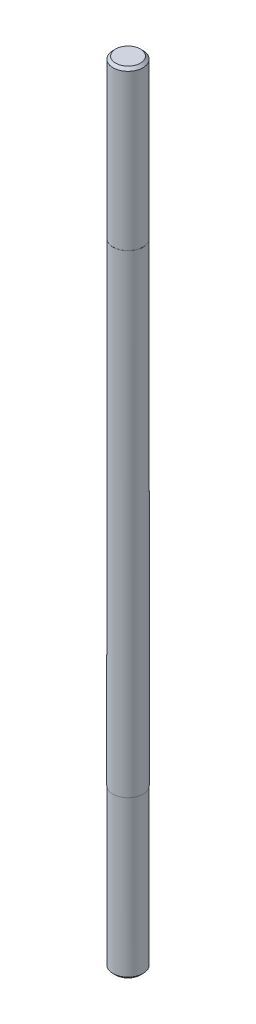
ISO-10303-21;
HEADER;
FILE_DESCRIPTION(('STEP AP214'),'2;1');
FILE_NAME('part.step','',(''),(''),'','','');
FILE_SCHEMA(('AUTOMOTIVE_DESIGN { 1 0 10303 214 1 1 1 1 }'));
ENDSEC;
DATA;
#1=APPLICATION_CONTEXT('core data for automotive mechanical design processes');
#2=APPLICATION_PROTOCOL_DEFINITION('international standard','automotive_design',2000,#1);
#3=PRODUCT_CONTEXT('',#1,'mechanical');
#4=PRODUCT('Part','Part','',(#3));
#5=PRODUCT_RELATED_PRODUCT_CATEGORY('part','',(#4));
#6=PRODUCT_DEFINITION_FORMATION('','',#4);
#7=PRODUCT_DEFINITION_CONTEXT('part definition',#1,'design');
#8=PRODUCT_DEFINITION('design','',#6,#7);
#9=PRODUCT_DEFINITION_SHAPE('','',#8);
#10=(LENGTH_UNIT() NAMED_UNIT(*) SI_UNIT(.MILLI.,.METRE.));
#11=(NAMED_UNIT(*) PLANE_ANGLE_UNIT() SI_UNIT($,.RADIAN.));
#12=(NAMED_UNIT(*) SI_UNIT($,.STERADIAN.) SOLID_ANGLE_UNIT());
#13=UNCERTAINTY_MEASURE_WITH_UNIT(LENGTH_MEASURE(1.E-05),#10,'distance_accuracy_value','');
#14=(GEOMETRIC_REPRESENTATION_CONTEXT(3) GLOBAL_UNCERTAINTY_ASSIGNED_CONTEXT((#13)) GLOBAL_UNIT_ASSIGNED_CONTEXT((#10,
#11,#12)) REPRESENTATION_CONTEXT('',''));
#15=CARTESIAN_POINT('',(0.,0.,0.));
#16=DIRECTION('',(0.,0.,1.));
#17=DIRECTION('',(1.,0.,0.));
#18=AXIS2_PLACEMENT_3D('',#15,#16,#17);
#19=CARTESIAN_POINT('',(0.,105.,0.));
#20=DIRECTION('',(0.,-1.,0.));
#21=DIRECTION('',(0.,0.,-1.));
#22=AXIS2_PLACEMENT_3D('',#19,#20,#21);
#23=CYLINDRICAL_SURFACE('',#22,2.);
#24=CARTESIAN_POINT('',(0.,84.,0.));
#25=DIRECTION('',(0.,1.,0.));
#26=DIRECTION('',(0.,0.,1.));
#27=AXIS2_PLACEMENT_3D('',#24,#25,#26);
#28=CIRCLE('',#27,2.);
#29=CARTESIAN_POINT('',(0.,84.,2.));
#30=VERTEX_POINT('',#29);
#31=EDGE_CURVE('E49',#30,#30,#28,.T.);
#32=ORIENTED_EDGE('',*,*,#31,.F.);
#33=EDGE_LOOP('',(#32));
#34=FACE_BOUND('',#33,.T.);
#35=CARTESIAN_POINT('',(0.,21.,0.));
#36=DIRECTION('',(0.,-1.,0.));
#37=DIRECTION('',(0.,0.,-1.));
#38=AXIS2_PLACEMENT_3D('',#35,#36,#37);
#39=CIRCLE('',#38,2.);
#40=CARTESIAN_POINT('',(0.,21.,-2.));
#41=VERTEX_POINT('',#40);
#42=EDGE_CURVE('E55',#41,#41,#39,.T.);
#43=ORIENTED_EDGE('',*,*,#42,.F.);
#44=EDGE_LOOP('',(#43));
#45=FACE_BOUND('',#44,.T.);
#46=ADVANCED_FACE('F30',(#34,#45),#23,.T.);
#47=CARTESIAN_POINT('',(0.,84.,0.));
#48=DIRECTION('',(0.,1.,0.));
#49=DIRECTION('',(0.,0.,1.));
#50=AXIS2_PLACEMENT_3D('',#47,#48,#49);
#51=PLANE('',#50);
#52=CARTESIAN_POINT('',(0.,84.,0.));
#53=DIRECTION('',(0.,1.,0.));
#54=DIRECTION('',(0.,0.,1.));
#55=AXIS2_PLACEMENT_3D('',#52,#53,#54);
#56=CIRCLE('',#55,1.99);
#57=CARTESIAN_POINT('',(0.,84.,1.99));
#58=VERTEX_POINT('',#57);
#59=EDGE_CURVE('E52',#58,#58,#56,.T.);
#60=ORIENTED_EDGE('',*,*,#59,.F.);
#61=EDGE_LOOP('',(#60));
#62=FACE_BOUND('',#61,.T.);
#63=ORIENTED_EDGE('',*,*,#31,.T.);
#64=EDGE_LOOP('',(#63));
#65=FACE_BOUND('',#64,.T.);
#66=ADVANCED_FACE('F72',(#62,#65),#51,.T.);
#67=CARTESIAN_POINT('',(0.,84.,0.));
#68=DIRECTION('',(0.,1.,0.));
#69=DIRECTION('',(0.,0.,1.));
#70=AXIS2_PLACEMENT_3D('',#67,#68,#69);
#71=CYLINDRICAL_SURFACE('',#70,1.99);
#72=CARTESIAN_POINT('',(0.,104.65,0.));
#73=DIRECTION('',(0.,1.,0.));
#74=DIRECTION('',(0.,0.,1.));
#75=AXIS2_PLACEMENT_3D('',#72,#73,#74);
#76=CIRCLE('',#75,1.99);
#77=CARTESIAN_POINT('',(0.,104.65,1.99));
#78=VERTEX_POINT('',#77);
#79=EDGE_CURVE('E10',#78,#78,#76,.F.);
#80=CARTESIAN_POINT('',(0.,104.65,1.99));
#81=CARTESIAN_POINT('',(0.,104.434895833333,1.99));
#82=CARTESIAN_POINT('',(0.,104.219791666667,1.99));
#83=CARTESIAN_POINT('',(0.,103.789583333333,1.99));
#84=CARTESIAN_POINT('',(0.,103.574479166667,1.99));
#85=CARTESIAN_POINT('',(0.,103.144270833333,1.99));
#86=CARTESIAN_POINT('',(0.,102.929166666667,1.99));
#87=CARTESIAN_POINT('',(0.,102.498958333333,1.99));
#88=CARTESIAN_POINT('',(0.,102.283854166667,1.99));
#89=CARTESIAN_POINT('',(0.,101.853645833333,1.99));
#90=CARTESIAN_POINT('',(0.,101.638541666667,1.99));
#91=CARTESIAN_POINT('',(0.,101.208333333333,1.99));
#92=CARTESIAN_POINT('',(0.,100.993229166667,1.99));
#93=CARTESIAN_POINT('',(0.,100.563020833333,1.99));
#94=CARTESIAN_POINT('',(0.,100.347916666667,1.99));
#95=CARTESIAN_POINT('',(0.,99.9177083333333,1.99));
#96=CARTESIAN_POINT('',(0.,99.7026041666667,1.99));
#97=CARTESIAN_POINT('',(0.,99.2723958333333,1.99));
#98=CARTESIAN_POINT('',(0.,99.0572916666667,1.99));
#99=CARTESIAN_POINT('',(0.,98.6270833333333,1.99));
#100=CARTESIAN_POINT('',(0.,98.4119791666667,1.99));
#101=CARTESIAN_POINT('',(0.,97.9817708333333,1.99));
#102=CARTESIAN_POINT('',(0.,97.7666666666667,1.99));
#103=CARTESIAN_POINT('',(0.,97.3364583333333,1.99));
#104=CARTESIAN_POINT('',(0.,97.1213541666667,1.99));
#105=CARTESIAN_POINT('',(0.,96.6911458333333,1.99));
#106=CARTESIAN_POINT('',(0.,96.4760416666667,1.99));
#107=CARTESIAN_POINT('',(0.,96.0458333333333,1.99));
#108=CARTESIAN_POINT('',(0.,95.8307291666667,1.99));
#109=CARTESIAN_POINT('',(0.,95.4005208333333,1.99));
#110=CARTESIAN_POINT('',(0.,95.1854166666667,1.99));
#111=CARTESIAN_POINT('',(0.,94.7552083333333,1.99));
#112=CARTESIAN_POINT('',(0.,94.5401041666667,1.99));
#113=CARTESIAN_POINT('',(0.,94.1098958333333,1.99));
#114=CARTESIAN_POINT('',(0.,93.8947916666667,1.99));
#115=CARTESIAN_POINT('',(0.,93.4645833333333,1.99));
#116=CARTESIAN_POINT('',(0.,93.2494791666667,1.99));
#117=CARTESIAN_POINT('',(0.,92.8192708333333,1.99));
#118=CARTESIAN_POINT('',(0.,92.6041666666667,1.99));
#119=CARTESIAN_POINT('',(0.,92.1739583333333,1.99));
#120=CARTESIAN_POINT('',(0.,91.9588541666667,1.99));
#121=CARTESIAN_POINT('',(0.,91.5286458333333,1.99));
#122=CARTESIAN_POINT('',(0.,91.3135416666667,1.99));
#123=CARTESIAN_POINT('',(0.,90.8833333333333,1.99));
#124=CARTESIAN_POINT('',(0.,90.6682291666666,1.99));
#125=CARTESIAN_POINT('',(0.,90.2380208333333,1.99));
#126=CARTESIAN_POINT('',(0.,90.0229166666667,1.99));
#127=CARTESIAN_POINT('',(0.,89.5927083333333,1.99));
#128=CARTESIAN_POINT('',(0.,89.3776041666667,1.99));
#129=CARTESIAN_POINT('',(0.,88.9473958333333,1.99));
#130=CARTESIAN_POINT('',(0.,88.7322916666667,1.99));
#131=CARTESIAN_POINT('',(0.,88.3020833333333,1.99));
#132=CARTESIAN_POINT('',(0.,88.0869791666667,1.99));
#133=CARTESIAN_POINT('',(0.,87.6567708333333,1.99));
#134=CARTESIAN_POINT('',(0.,87.4416666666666,1.99));
#135=CARTESIAN_POINT('',(0.,87.0114583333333,1.99));
#136=CARTESIAN_POINT('',(0.,86.7963541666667,1.99));
#137=CARTESIAN_POINT('',(0.,86.3661458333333,1.99));
#138=CARTESIAN_POINT('',(0.,86.1510416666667,1.99));
#139=CARTESIAN_POINT('',(0.,85.7208333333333,1.99));
#140=CARTESIAN_POINT('',(0.,85.5057291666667,1.99));
#141=CARTESIAN_POINT('',(0.,85.0755208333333,1.99));
#142=CARTESIAN_POINT('',(0.,84.8604166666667,1.99));
#143=CARTESIAN_POINT('',(0.,84.4302083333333,1.99));
#144=CARTESIAN_POINT('',(0.,84.2151041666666,1.99));
#145=CARTESIAN_POINT('',(0.,84.,1.99));
#146=B_SPLINE_CURVE_WITH_KNOTS('',3,(#80,#81,#82,#83,#84,#85,#86,#87,#88,#89,#90,#91,#92,#93,
#94,#95,#96,#97,#98,#99,#100,#101,#102,#103,#104,#105,#106,#107,#108,#109,#110,#111,#112,#113,
#114,#115,#116,#117,#118,#119,#120,#121,#122,#123,#124,#125,#126,#127,#128,#129,#130,#131,#132,
#133,#134,#135,#136,#137,#138,#139,#140,#141,#142,#143,#144,#145),.UNSPECIFIED.,.F.,.F.,(4,2,2,
2,2,2,2,2,2,2,2,2,2,2,2,2,2,2,2,2,2,2,2,2,2,2,2,2,2,2,2,2,4),(0.,0.645312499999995,1.290625,
1.9359375,2.58124999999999,3.2265625,3.871875,4.51718750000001,5.1625,5.80781250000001,6.453125,
7.0984375,7.74375000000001,8.3890625,9.03437500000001,9.67968750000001,10.325,10.9703125,
11.615625,12.2609375,12.90625,13.5515625,14.196875,14.8421875,15.4875,16.1328125,16.778125,
17.4234375,18.06875,18.7140625,19.359375,20.0046875,20.65),.UNSPECIFIED.);
#147=EDGE_CURVE('BSEAM77',#78,#58,#146,.T.);
#148=ORIENTED_EDGE('',*,*,#79,.T.);
#149=ORIENTED_EDGE('',*,*,#59,.T.);
#150=ORIENTED_EDGE('',*,*,#147,.T.);
#151=ORIENTED_EDGE('',*,*,#147,.F.);
#152=EDGE_LOOP('',(#148,#150,#149,#151));
#153=FACE_BOUND('',#152,.T.);
#154=ADVANCED_FACE('F77',(#153),#71,.T.);
#155=CARTESIAN_POINT('',(0.,105.,0.));
#156=DIRECTION('',(0.,1.,0.));
#157=DIRECTION('',(0.,0.,1.));
#158=AXIS2_PLACEMENT_3D('',#155,#156,#157);
#159=PLANE('',#158);
#160=CARTESIAN_POINT('',(0.,105.,0.));
#161=DIRECTION('',(0.,1.,0.));
#162=DIRECTION('',(0.,0.,1.));
#163=AXIS2_PLACEMENT_3D('',#160,#161,#162);
#164=CIRCLE('',#163,1.64000000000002);
#165=CARTESIAN_POINT('',(0.,105.,1.64000000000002));
#166=VERTEX_POINT('',#165);
#167=EDGE_CURVE('E36',#166,#166,#164,.T.);
#168=ORIENTED_EDGE('',*,*,#167,.T.);
#169=EDGE_LOOP('',(#168));
#170=FACE_BOUND('',#169,.T.);
#171=ADVANCED_FACE('F67',(#170),#159,.T.);
#172=CARTESIAN_POINT('',(0.,21.,0.));
#173=DIRECTION('',(0.,-1.,0.));
#174=DIRECTION('',(0.,0.,-1.));
#175=AXIS2_PLACEMENT_3D('',#172,#173,#174);
#176=PLANE('',#175);
#177=CARTESIAN_POINT('',(0.,21.,0.));
#178=DIRECTION('',(0.,-1.,0.));
#179=DIRECTION('',(0.,0.,-1.));
#180=AXIS2_PLACEMENT_3D('',#177,#178,#179);
#181=CIRCLE('',#180,1.999);
#182=CARTESIAN_POINT('',(0.,21.,-1.999));
#183=VERTEX_POINT('',#182);
#184=EDGE_CURVE('E58',#183,#183,#181,.T.);
#185=ORIENTED_EDGE('',*,*,#184,.F.);
#186=EDGE_LOOP('',(#185));
#187=FACE_BOUND('',#186,.T.);
#188=ORIENTED_EDGE('',*,*,#42,.T.);
#189=EDGE_LOOP('',(#188));
#190=FACE_BOUND('',#189,.T.);
#191=ADVANCED_FACE('F64',(#187,#190),#176,.T.);
#192=CARTESIAN_POINT('',(0.,21.,0.));
#193=DIRECTION('',(0.,-1.,0.));
#194=DIRECTION('',(0.,0.,-1.));
#195=AXIS2_PLACEMENT_3D('',#192,#193,#194);
#196=CYLINDRICAL_SURFACE('',#195,1.999);
#197=CARTESIAN_POINT('',(0.,0.349999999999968,0.));
#198=DIRECTION('',(0.,1.,0.));
#199=DIRECTION('',(0.,0.,1.));
#200=AXIS2_PLACEMENT_3D('',#197,#198,#199);
#201=CIRCLE('',#200,1.999);
#202=CARTESIAN_POINT('',(0.,0.349999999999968,-1.999));
#203=VERTEX_POINT('',#202);
#204=EDGE_CURVE('E40',#203,#203,#201,.T.);
#205=CARTESIAN_POINT('',(0.,0.349999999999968,-1.999));
#206=CARTESIAN_POINT('',(0.,0.565104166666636,-1.999));
#207=CARTESIAN_POINT('',(0.,0.780208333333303,-1.999));
#208=CARTESIAN_POINT('',(0.,1.21041666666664,-1.999));
#209=CARTESIAN_POINT('',(0.,1.4255208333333,-1.999));
#210=CARTESIAN_POINT('',(0.,1.85572916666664,-1.999));
#211=CARTESIAN_POINT('',(0.,2.0708333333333,-1.999));
#212=CARTESIAN_POINT('',(0.,2.50104166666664,-1.999));
#213=CARTESIAN_POINT('',(0.,2.7161458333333,-1.999));
#214=CARTESIAN_POINT('',(0.,3.14635416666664,-1.999));
#215=CARTESIAN_POINT('',(0.,3.36145833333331,-1.999));
#216=CARTESIAN_POINT('',(0.,3.79166666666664,-1.999));
#217=CARTESIAN_POINT('',(0.,4.00677083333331,-1.999));
#218=CARTESIAN_POINT('',(0.,4.43697916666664,-1.999));
#219=CARTESIAN_POINT('',(0.,4.65208333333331,-1.999));
#220=CARTESIAN_POINT('',(0.,5.08229166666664,-1.999));
#221=CARTESIAN_POINT('',(0.,5.29739583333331,-1.999));
#222=CARTESIAN_POINT('',(0.,5.72760416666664,-1.999));
#223=CARTESIAN_POINT('',(0.,5.94270833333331,-1.999));
#224=CARTESIAN_POINT('',(0.,6.37291666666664,-1.999));
#225=CARTESIAN_POINT('',(0.,6.58802083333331,-1.999));
#226=CARTESIAN_POINT('',(0.,7.01822916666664,-1.999));
#227=CARTESIAN_POINT('',(0.,7.23333333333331,-1.999));
#228=CARTESIAN_POINT('',(0.,7.66354166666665,-1.999));
#229=CARTESIAN_POINT('',(0.,7.87864583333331,-1.999));
#230=CARTESIAN_POINT('',(0.,8.30885416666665,-1.999));
#231=CARTESIAN_POINT('',(0.,8.52395833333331,-1.999));
#232=CARTESIAN_POINT('',(0.,8.95416666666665,-1.999));
#233=CARTESIAN_POINT('',(0.,9.16927083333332,-1.999));
#234=CARTESIAN_POINT('',(0.,9.59947916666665,-1.999));
#235=CARTESIAN_POINT('',(0.,9.81458333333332,-1.999));
#236=CARTESIAN_POINT('',(0.,10.2447916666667,-1.999));
#237=CARTESIAN_POINT('',(0.,10.4598958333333,-1.999));
#238=CARTESIAN_POINT('',(0.,10.8901041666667,-1.999));
#239=CARTESIAN_POINT('',(0.,11.1052083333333,-1.999));
#240=CARTESIAN_POINT('',(0.,11.5354166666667,-1.999));
#241=CARTESIAN_POINT('',(0.,11.7505208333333,-1.999));
#242=CARTESIAN_POINT('',(0.,12.1807291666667,-1.999));
#243=CARTESIAN_POINT('',(0.,12.3958333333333,-1.999));
#244=CARTESIAN_POINT('',(0.,12.8260416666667,-1.999));
#245=CARTESIAN_POINT('',(0.,13.0411458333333,-1.999));
#246=CARTESIAN_POINT('',(0.,13.4713541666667,-1.999));
#247=CARTESIAN_POINT('',(0.,13.6864583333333,-1.999));
#248=CARTESIAN_POINT('',(0.,14.1166666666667,-1.999));
#249=CARTESIAN_POINT('',(0.,14.3317708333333,-1.999));
#250=CARTESIAN_POINT('',(0.,14.7619791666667,-1.999));
#251=CARTESIAN_POINT('',(0.,14.9770833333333,-1.999));
#252=CARTESIAN_POINT('',(0.,15.4072916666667,-1.999));
#253=CARTESIAN_POINT('',(0.,15.6223958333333,-1.999));
#254=CARTESIAN_POINT('',(0.,16.0526041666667,-1.999));
#255=CARTESIAN_POINT('',(0.,16.2677083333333,-1.999));
#256=CARTESIAN_POINT('',(0.,16.6979166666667,-1.999));
#257=CARTESIAN_POINT('',(0.,16.9130208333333,-1.999));
#258=CARTESIAN_POINT('',(0.,17.3432291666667,-1.999));
#259=CARTESIAN_POINT('',(0.,17.5583333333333,-1.999));
#260=CARTESIAN_POINT('',(0.,17.9885416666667,-1.999));
#261=CARTESIAN_POINT('',(0.,18.2036458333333,-1.999));
#262=CARTESIAN_POINT('',(0.,18.6338541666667,-1.999));
#263=CARTESIAN_POINT('',(0.,18.8489583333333,-1.999));
#264=CARTESIAN_POINT('',(0.,19.2791666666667,-1.999));
#265=CARTESIAN_POINT('',(0.,19.4942708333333,-1.999));
#266=CARTESIAN_POINT('',(0.,19.9244791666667,-1.999));
#267=CARTESIAN_POINT('',(0.,20.1395833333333,-1.999));
#268=CARTESIAN_POINT('',(0.,20.5697916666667,-1.999));
#269=CARTESIAN_POINT('',(0.,20.7848958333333,-1.999));
#270=CARTESIAN_POINT('',(0.,21.,-1.999));
#271=B_SPLINE_CURVE_WITH_KNOTS('',3,(#205,#206,#207,#208,#209,#210,#211,#212,#213,#214,#215,
#216,#217,#218,#219,#220,#221,#222,#223,#224,#225,#226,#227,#228,#229,#230,#231,#232,#233,#234,
#235,#236,#237,#238,#239,#240,#241,#242,#243,#244,#245,#246,#247,#248,#249,#250,#251,#252,#253,
#254,#255,#256,#257,#258,#259,#260,#261,#262,#263,#264,#265,#266,#267,#268,#269,#270),
.UNSPECIFIED.,.F.,.F.,(4,2,2,2,2,2,2,2,2,2,2,2,2,2,2,2,2,2,2,2,2,2,2,2,2,2,2,2,2,2,2,2,4),(0.,
0.645312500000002,1.290625,1.9359375,2.58125,3.22656250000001,3.87187500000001,4.51718750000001,
5.16250000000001,5.80781250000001,6.45312500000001,7.09843750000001,7.74375000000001,
8.38906250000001,9.03437500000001,9.67968750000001,10.325,10.9703125,11.615625,12.2609375,
12.90625,13.5515625,14.196875,14.8421875,15.4875,16.1328125,16.778125,17.4234375,18.06875,
18.7140625,19.359375,20.0046875,20.65),.UNSPECIFIED.);
#272=EDGE_CURVE('BSEAM62',#203,#183,#271,.T.);
#273=ORIENTED_EDGE('',*,*,#204,.T.);
#274=ORIENTED_EDGE('',*,*,#184,.T.);
#275=ORIENTED_EDGE('',*,*,#272,.T.);
#276=ORIENTED_EDGE('',*,*,#272,.F.);
#277=EDGE_LOOP('',(#273,#275,#274,#276));
#278=FACE_BOUND('',#277,.T.);
#279=ADVANCED_FACE('F62',(#278),#196,.T.);
#280=CARTESIAN_POINT('',(0.,0.,0.));
#281=DIRECTION('',(0.,1.,0.));
#282=DIRECTION('',(0.,0.,1.));
#283=AXIS2_PLACEMENT_3D('',#280,#281,#282);
#284=PLANE('',#283);
#285=CARTESIAN_POINT('',(0.,0.,0.));
#286=DIRECTION('',(0.,1.,0.));
#287=DIRECTION('',(0.,0.,1.));
#288=AXIS2_PLACEMENT_3D('',#285,#286,#287);
#289=CIRCLE('',#288,1.64900000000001);
#290=CARTESIAN_POINT('',(0.,0.,1.64900000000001));
#291=VERTEX_POINT('',#290);
#292=EDGE_CURVE('E44',#291,#291,#289,.F.);
#293=ORIENTED_EDGE('',*,*,#292,.T.);
#294=EDGE_LOOP('',(#293));
#295=FACE_BOUND('',#294,.T.);
#296=ADVANCED_FACE('F88',(#295),#284,.F.);
#297=CARTESIAN_POINT('',(0.,0.,0.));
#298=DIRECTION('',(0.,1.,0.));
#299=DIRECTION('',(0.,0.,1.));
#300=AXIS2_PLACEMENT_3D('',#297,#298,#299);
#301=CONICAL_SURFACE('',#300,1.64900000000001,0.785398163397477);
#302=ORIENTED_EDGE('',*,*,#204,.F.);
#303=EDGE_LOOP('',(#302));
#304=FACE_BOUND('',#303,.T.);
#305=ORIENTED_EDGE('',*,*,#292,.F.);
#306=EDGE_LOOP('',(#305));
#307=FACE_BOUND('',#306,.T.);
#308=ADVANCED_FACE('F90',(#304,#307),#301,.T.);
#309=CARTESIAN_POINT('',(0.,105.,0.));
#310=DIRECTION('',(0.,-1.,0.));
#311=DIRECTION('',(0.,0.,-1.));
#312=AXIS2_PLACEMENT_3D('',#309,#310,#311);
#313=CONICAL_SURFACE('',#312,1.64000000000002,0.785398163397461);
#314=ORIENTED_EDGE('',*,*,#79,.F.);
#315=EDGE_LOOP('',(#314));
#316=FACE_BOUND('',#315,.T.);
#317=ORIENTED_EDGE('',*,*,#167,.F.);
#318=EDGE_LOOP('',(#317));
#319=FACE_BOUND('',#318,.T.);
#320=ADVANCED_FACE('F118',(#316,#319),#313,.T.);
#321=CLOSED_SHELL('',(#46,#66,#154,#171,#191,#279,#296,#308,#320));
#322=MANIFOLD_SOLID_BREP('B2',#321);
#323=ADVANCED_BREP_SHAPE_REPRESENTATION('',(#18,#322),#14);
#324=SHAPE_DEFINITION_REPRESENTATION(#9,#323);
ENDSEC;
END-ISO-10303-21;
